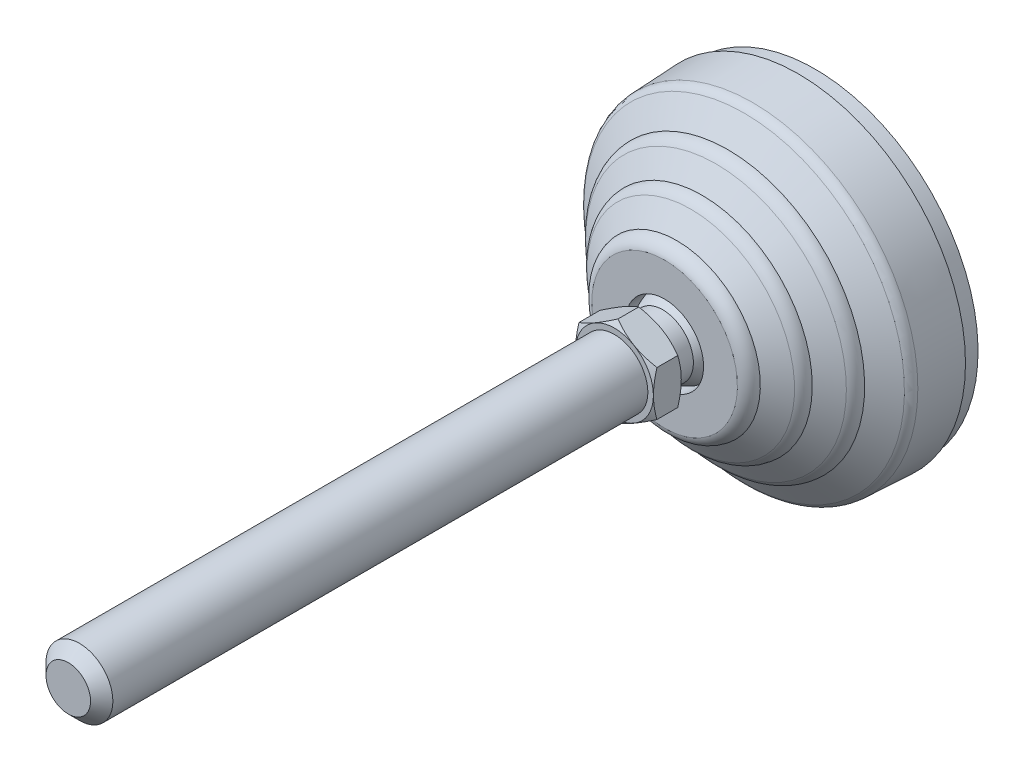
ISO-10303-21;
HEADER;
FILE_DESCRIPTION(('STEP AP214'),'2;1');
FILE_NAME('part.step','',(''),(''),'','','');
FILE_SCHEMA(('AUTOMOTIVE_DESIGN { 1 0 10303 214 1 1 1 1 }'));
ENDSEC;
DATA;
#1=APPLICATION_CONTEXT('core data for automotive mechanical design processes');
#2=APPLICATION_PROTOCOL_DEFINITION('international standard','automotive_design',2000,#1);
#3=PRODUCT_CONTEXT('',#1,'mechanical');
#4=PRODUCT('Part','Part','',(#3));
#5=PRODUCT_RELATED_PRODUCT_CATEGORY('part','',(#4));
#6=PRODUCT_DEFINITION_FORMATION('','',#4);
#7=PRODUCT_DEFINITION_CONTEXT('part definition',#1,'design');
#8=PRODUCT_DEFINITION('design','',#6,#7);
#9=PRODUCT_DEFINITION_SHAPE('','',#8);
#10=(LENGTH_UNIT() NAMED_UNIT(*) SI_UNIT(.MILLI.,.METRE.));
#11=(NAMED_UNIT(*) PLANE_ANGLE_UNIT() SI_UNIT($,.RADIAN.));
#12=(NAMED_UNIT(*) SI_UNIT($,.STERADIAN.) SOLID_ANGLE_UNIT());
#13=UNCERTAINTY_MEASURE_WITH_UNIT(LENGTH_MEASURE(1.E-05),#10,'distance_accuracy_value','');
#14=(GEOMETRIC_REPRESENTATION_CONTEXT(3) GLOBAL_UNCERTAINTY_ASSIGNED_CONTEXT((#13)) GLOBAL_UNIT_ASSIGNED_CONTEXT((#10,
#11,#12)) REPRESENTATION_CONTEXT('',''));
#15=CARTESIAN_POINT('',(0.,0.,0.));
#16=DIRECTION('',(0.,0.,1.));
#17=DIRECTION('',(1.,0.,0.));
#18=AXIS2_PLACEMENT_3D('',#15,#16,#17);
#19=CARTESIAN_POINT('',(0.,0.,35.));
#20=DIRECTION('',(0.,0.,-1.));
#21=DIRECTION('',(0.,1.,0.));
#22=AXIS2_PLACEMENT_3D('',#19,#20,#21);
#23=CYLINDRICAL_SURFACE('',#22,7.);
#24=CARTESIAN_POINT('',(-7.,0.,23.));
#25=CARTESIAN_POINT('',(-7.00000242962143,-0.114537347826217,23.));
#26=CARTESIAN_POINT('',(-6.99718891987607,-0.229074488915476,23.));
#27=CARTESIAN_POINT('',(-6.98594746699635,-0.45787295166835,23.));
#28=CARTESIAN_POINT('',(-6.97751952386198,-0.572134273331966,23.));
#29=CARTESIAN_POINT('',(-6.95506664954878,-0.800105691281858,23.));
#30=CARTESIAN_POINT('',(-6.94104171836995,-0.913815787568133,23.));
#31=CARTESIAN_POINT('',(-6.90742942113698,-1.14041085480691,23.));
#32=CARTESIAN_POINT('',(-6.88784205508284,-1.25329582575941,23.));
#33=CARTESIAN_POINT('',(-6.84315187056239,-1.47796868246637,23.));
#34=CARTESIAN_POINT('',(-6.81804905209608,-1.58975656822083,23.));
#35=CARTESIAN_POINT('',(-6.76238849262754,-1.81196595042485,23.));
#36=CARTESIAN_POINT('',(-6.73183075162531,-1.9223874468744,23.));
#37=CARTESIAN_POINT('',(-6.66533394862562,-2.14159803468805,23.));
#38=CARTESIAN_POINT('',(-6.62939488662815,-2.25038712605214,23.));
#39=CARTESIAN_POINT('',(-6.55222202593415,-2.46607082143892,23.));
#40=CARTESIAN_POINT('',(-6.51098822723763,-2.5729654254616,23.));
#41=CARTESIAN_POINT('',(-6.42332522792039,-2.78460262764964,23.));
#42=CARTESIAN_POINT('',(-6.37689602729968,-2.88934522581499,23.));
#43=CARTESIAN_POINT('',(-6.27895407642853,-3.09642608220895,23.));
#44=CARTESIAN_POINT('',(-6.22744132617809,-3.19876434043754,23.));
#45=CARTESIAN_POINT('',(-6.11945637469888,-3.40078997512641,23.));
#46=CARTESIAN_POINT('',(-6.06298417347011,-3.50047735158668,23.));
#47=CARTESIAN_POINT('',(-5.94521636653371,-3.69696106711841,23.));
#48=CARTESIAN_POINT('',(-5.88392076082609,-3.79375740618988,23.));
#49=CARTESIAN_POINT('',(-5.75665381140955,-3.98422585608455,23.));
#50=CARTESIAN_POINT('',(-5.69068246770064,-4.07789796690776,23.));
#51=CARTESIAN_POINT('',(-5.55422297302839,-4.26189229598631,23.));
#52=CARTESIAN_POINT('',(-5.48373482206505,-4.35221451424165,23.));
#53=CARTESIAN_POINT('',(-5.33841152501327,-4.52929146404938,23.));
#54=CARTESIAN_POINT('',(-5.26357637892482,-4.61604619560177,23.));
#55=CARTESIAN_POINT('',(-5.10973937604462,-4.78577917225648,23.));
#56=CARTESIAN_POINT('',(-5.03073751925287,-4.8687574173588,23.));
#57=CARTESIAN_POINT('',(-4.8687574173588,-5.03073751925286,23.));
#58=CARTESIAN_POINT('',(-4.78577917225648,-5.10973937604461,23.));
#59=CARTESIAN_POINT('',(-4.61604619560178,-5.26357637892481,23.));
#60=CARTESIAN_POINT('',(-4.52929146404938,-5.33841152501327,23.));
#61=CARTESIAN_POINT('',(-4.35221451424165,-5.48373482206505,23.));
#62=CARTESIAN_POINT('',(-4.26189229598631,-5.55422297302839,23.));
#63=CARTESIAN_POINT('',(-4.07789796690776,-5.69068246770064,23.));
#64=CARTESIAN_POINT('',(-3.98422585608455,-5.75665381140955,23.));
#65=CARTESIAN_POINT('',(-3.79375740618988,-5.88392076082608,23.));
#66=CARTESIAN_POINT('',(-3.69696106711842,-5.9452163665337,23.));
#67=CARTESIAN_POINT('',(-3.50047735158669,-6.0629841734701,23.));
#68=CARTESIAN_POINT('',(-3.40078997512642,-6.11945637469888,23.));
#69=CARTESIAN_POINT('',(-3.19876434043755,-6.22744132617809,23.));
#70=CARTESIAN_POINT('',(-3.09642608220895,-6.27895407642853,23.));
#71=CARTESIAN_POINT('',(-2.88934522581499,-6.37689602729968,23.));
#72=CARTESIAN_POINT('',(-2.78460262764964,-6.42332522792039,23.));
#73=CARTESIAN_POINT('',(-2.57296542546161,-6.51098822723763,23.));
#74=CARTESIAN_POINT('',(-2.46607082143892,-6.55222202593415,23.));
#75=CARTESIAN_POINT('',(-2.25038712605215,-6.62939488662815,23.));
#76=CARTESIAN_POINT('',(-2.14159803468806,-6.66533394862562,23.));
#77=CARTESIAN_POINT('',(-1.92238744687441,-6.73183075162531,23.));
#78=CARTESIAN_POINT('',(-1.81196595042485,-6.76238849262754,23.));
#79=CARTESIAN_POINT('',(-1.58975656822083,-6.81804905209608,23.));
#80=CARTESIAN_POINT('',(-1.47796868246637,-6.84315187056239,23.));
#81=CARTESIAN_POINT('',(-1.25329582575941,-6.88784205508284,23.));
#82=CARTESIAN_POINT('',(-1.14041085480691,-6.90742942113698,23.));
#83=CARTESIAN_POINT('',(-0.913815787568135,-6.94104171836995,23.));
#84=CARTESIAN_POINT('',(-0.80010569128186,-6.95506664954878,23.));
#85=CARTESIAN_POINT('',(-0.572134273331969,-6.97751952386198,23.));
#86=CARTESIAN_POINT('',(-0.457872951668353,-6.98594746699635,23.));
#87=CARTESIAN_POINT('',(-0.229074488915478,-6.99718891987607,23.));
#88=CARTESIAN_POINT('',(-0.11453734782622,-7.00000242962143,23.));
#89=CARTESIAN_POINT('',(0.,-7.,23.));
#90=B_SPLINE_CURVE_WITH_KNOTS('',3,(#24,#25,#26,#27,#28,#29,#30,#31,#32,#33,#34,#35,#36,#37,#38,
#39,#40,#41,#42,#43,#44,#45,#46,#47,#48,#49,#50,#51,#52,#53,#54,#55,#56,#57,#58,#59,#60,#61,#62,
#63,#64,#65,#66,#67,#68,#69,#70,#71,#72,#73,#74,#75,#76,#77,#78,#79,#80,#81,#82,#83,#84,#85,#86,
#87,#88,#89),.UNSPECIFIED.,.F.,.F.,(4,2,2,2,2,2,2,2,2,2,2,2,2,2,2,2,2,2,2,2,2,2,2,2,2,2,2,2,2,2,
2,2,4),(0.,0.343577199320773,0.687154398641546,1.03073159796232,1.37430879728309,
1.71788599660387,2.06146319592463,2.40504039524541,2.74861759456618,3.09219479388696,
3.43577199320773,3.7793491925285,4.12292639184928,4.46650359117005,4.81008079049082,
5.15365798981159,5.49723518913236,5.84081238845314,6.18438958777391,6.52796678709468,
6.87154398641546,7.21512118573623,7.558698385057,7.90227558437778,8.24585278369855,
8.58942998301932,8.93300718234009,9.27658438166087,9.62016158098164,9.96373878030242,
10.3073159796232,10.650893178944,10.9944703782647),.UNSPECIFIED.);
#91=CARTESIAN_POINT('',(-7.,0.,23.0001794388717));
#92=VERTEX_POINT('',#91);
#93=CARTESIAN_POINT('',(0.,-7.,23.));
#94=VERTEX_POINT('',#93);
#95=EDGE_CURVE('E138',#92,#94,#90,.T.);
#96=ORIENTED_EDGE('',*,*,#95,.F.);
#97=CARTESIAN_POINT('',(0.,0.,23.));
#98=DIRECTION('',(0.,0.,-1.));
#99=DIRECTION('',(0.,1.,0.));
#100=AXIS2_PLACEMENT_3D('',#97,#98,#99);
#101=CIRCLE('',#100,7.);
#102=CARTESIAN_POINT('',(0.,7.,23.));
#103=VERTEX_POINT('',#102);
#104=EDGE_CURVE('E134',#103,#92,#101,.F.);
#105=ORIENTED_EDGE('',*,*,#104,.F.);
#106=CARTESIAN_POINT('',(7.,0.,23.));
#107=CARTESIAN_POINT('',(7.00000242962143,0.114537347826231,22.9999999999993));
#108=CARTESIAN_POINT('',(6.99718891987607,0.22907448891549,22.9999999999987));
#109=CARTESIAN_POINT('',(6.98594746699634,0.457872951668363,22.9999999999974));
#110=CARTESIAN_POINT('',(6.97751952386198,0.572134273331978,22.9999999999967));
#111=CARTESIAN_POINT('',(6.95506664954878,0.800105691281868,22.9999999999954));
#112=CARTESIAN_POINT('',(6.94104171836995,0.913815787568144,22.9999999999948));
#113=CARTESIAN_POINT('',(6.90742942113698,1.14041085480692,22.9999999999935));
#114=CARTESIAN_POINT('',(6.88784205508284,1.25329582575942,22.9999999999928));
#115=CARTESIAN_POINT('',(6.84315187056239,1.47796868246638,22.9999999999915));
#116=CARTESIAN_POINT('',(6.81804905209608,1.58975656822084,22.9999999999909));
#117=CARTESIAN_POINT('',(6.76238849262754,1.81196595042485,22.9999999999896));
#118=CARTESIAN_POINT('',(6.73183075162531,1.92238744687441,22.999999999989));
#119=CARTESIAN_POINT('',(6.66533394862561,2.14159803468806,22.9999999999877));
#120=CARTESIAN_POINT('',(6.62939488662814,2.25038712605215,22.9999999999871));
#121=CARTESIAN_POINT('',(6.55222202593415,2.46607082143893,22.9999999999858));
#122=CARTESIAN_POINT('',(6.51098822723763,2.57296542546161,22.9999999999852));
#123=CARTESIAN_POINT('',(6.42332522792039,2.78460262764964,22.999999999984));
#124=CARTESIAN_POINT('',(6.37689602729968,2.88934522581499,22.9999999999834));
#125=CARTESIAN_POINT('',(6.27895407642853,3.09642608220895,22.9999999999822));
#126=CARTESIAN_POINT('',(6.22744132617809,3.19876434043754,22.9999999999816));
#127=CARTESIAN_POINT('',(6.11945637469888,3.40078997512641,22.9999999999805));
#128=CARTESIAN_POINT('',(6.06298417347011,3.50047735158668,22.9999999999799));
#129=CARTESIAN_POINT('',(5.94521636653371,3.69696106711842,22.9999999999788));
#130=CARTESIAN_POINT('',(5.88392076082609,3.79375740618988,22.9999999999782));
#131=CARTESIAN_POINT('',(5.75665381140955,3.98422585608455,22.9999999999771));
#132=CARTESIAN_POINT('',(5.69068246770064,4.07789796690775,22.9999999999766));
#133=CARTESIAN_POINT('',(5.55422297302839,4.26189229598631,22.9999999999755));
#134=CARTESIAN_POINT('',(5.48373482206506,4.35221451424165,22.999999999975));
#135=CARTESIAN_POINT('',(5.33841152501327,4.52929146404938,22.999999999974));
#136=CARTESIAN_POINT('',(5.26357637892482,4.61604619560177,22.9999999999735));
#137=CARTESIAN_POINT('',(5.10973937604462,4.78577917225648,22.9999999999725));
#138=CARTESIAN_POINT('',(5.03073751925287,4.8687574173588,22.9999999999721));
#139=CARTESIAN_POINT('',(4.8687574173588,5.03073751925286,22.9999999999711));
#140=CARTESIAN_POINT('',(4.78577917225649,5.10973937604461,22.9999999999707));
#141=CARTESIAN_POINT('',(4.61604619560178,5.26357637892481,22.9999999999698));
#142=CARTESIAN_POINT('',(4.52929146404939,5.33841152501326,22.9999999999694));
#143=CARTESIAN_POINT('',(4.35221451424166,5.48373482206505,22.9999999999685));
#144=CARTESIAN_POINT('',(4.26189229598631,5.55422297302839,22.9999999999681));
#145=CARTESIAN_POINT('',(4.07789796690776,5.69068246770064,22.9999999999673));
#146=CARTESIAN_POINT('',(3.98422585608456,5.75665381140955,22.999999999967));
#147=CARTESIAN_POINT('',(3.79375740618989,5.88392076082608,22.9999999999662));
#148=CARTESIAN_POINT('',(3.69696106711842,5.9452163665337,22.9999999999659));
#149=CARTESIAN_POINT('',(3.50047735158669,6.0629841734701,22.9999999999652));
#150=CARTESIAN_POINT('',(3.40078997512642,6.11945637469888,22.9999999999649));
#151=CARTESIAN_POINT('',(3.19876434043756,6.22744132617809,22.9999999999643));
#152=CARTESIAN_POINT('',(3.09642608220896,6.27895407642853,22.999999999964));
#153=CARTESIAN_POINT('',(2.88934522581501,6.37689602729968,22.9999999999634));
#154=CARTESIAN_POINT('',(2.78460262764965,6.42332522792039,22.9999999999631));
#155=CARTESIAN_POINT('',(2.57296542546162,6.51098822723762,22.9999999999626));
#156=CARTESIAN_POINT('',(2.46607082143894,6.55222202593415,22.9999999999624));
#157=CARTESIAN_POINT('',(2.25038712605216,6.62939488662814,22.999999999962));
#158=CARTESIAN_POINT('',(2.14159803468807,6.66533394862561,22.9999999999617));
#159=CARTESIAN_POINT('',(1.92238744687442,6.73183075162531,22.9999999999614));
#160=CARTESIAN_POINT('',(1.81196595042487,6.76238849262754,22.9999999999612));
#161=CARTESIAN_POINT('',(1.58975656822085,6.81804905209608,22.9999999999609));
#162=CARTESIAN_POINT('',(1.47796868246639,6.84315187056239,22.9999999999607));
#163=CARTESIAN_POINT('',(1.25329582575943,6.88784205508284,22.9999999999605));
#164=CARTESIAN_POINT('',(1.14041085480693,6.90742942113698,22.9999999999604));
#165=CARTESIAN_POINT('',(0.913815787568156,6.94104171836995,22.9999999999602));
#166=CARTESIAN_POINT('',(0.80010569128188,6.95506664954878,22.9999999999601));
#167=CARTESIAN_POINT('',(0.572134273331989,6.97751952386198,22.9999999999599));
#168=CARTESIAN_POINT('',(0.457872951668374,6.98594746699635,22.9999999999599));
#169=CARTESIAN_POINT('',(0.229074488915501,6.99718891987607,22.9999999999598));
#170=CARTESIAN_POINT('',(0.114537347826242,7.00000242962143,22.9999999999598));
#171=CARTESIAN_POINT('',(0.,7.,22.9999999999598));
#172=B_SPLINE_CURVE_WITH_KNOTS('',3,(#106,#107,#108,#109,#110,#111,#112,#113,#114,#115,#116,
#117,#118,#119,#120,#121,#122,#123,#124,#125,#126,#127,#128,#129,#130,#131,#132,#133,#134,#135,
#136,#137,#138,#139,#140,#141,#142,#143,#144,#145,#146,#147,#148,#149,#150,#151,#152,#153,#154,
#155,#156,#157,#158,#159,#160,#161,#162,#163,#164,#165,#166,#167,#168,#169,#170,#171),
.UNSPECIFIED.,.F.,.F.,(4,2,2,2,2,2,2,2,2,2,2,2,2,2,2,2,2,2,2,2,2,2,2,2,2,2,2,2,2,2,2,2,4),(0.,
0.343577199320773,0.687154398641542,1.03073159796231,1.37430879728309,1.71788599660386,
2.06146319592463,2.4050403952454,2.74861759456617,3.09219479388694,3.43577199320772,
3.77934919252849,4.12292639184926,4.46650359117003,4.8100807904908,5.15365798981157,
5.49723518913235,5.84081238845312,6.18438958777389,6.52796678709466,6.87154398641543,
7.21512118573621,7.55869838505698,7.90227558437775,8.24585278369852,8.58942998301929,
8.93300718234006,9.27658438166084,9.62016158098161,9.96373878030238,10.3073159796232,
10.6508931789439,10.9944703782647),.UNSPECIFIED.);
#173=CARTESIAN_POINT('',(7.,0.,23.));
#174=VERTEX_POINT('',#173);
#175=EDGE_CURVE('E31',#174,#103,#172,.T.);
#176=ORIENTED_EDGE('',*,*,#175,.F.);
#177=CARTESIAN_POINT('',(0.,0.,23.));
#178=DIRECTION('',(0.,0.,-1.));
#179=DIRECTION('',(0.,1.,0.));
#180=AXIS2_PLACEMENT_3D('',#177,#178,#179);
#181=CIRCLE('',#180,7.);
#182=EDGE_CURVE('E135',#94,#174,#181,.F.);
#183=ORIENTED_EDGE('',*,*,#182,.F.);
#184=EDGE_LOOP('',(#96,#105,#176,#183));
#185=FACE_BOUND('',#184,.T.);
#186=CARTESIAN_POINT('',(0.,0.,27.));
#187=DIRECTION('',(0.,0.,-1.));
#188=DIRECTION('',(0.,1.,0.));
#189=AXIS2_PLACEMENT_3D('',#186,#187,#188);
#190=CIRCLE('',#189,7.);
#191=CARTESIAN_POINT('',(0.,7.,27.));
#192=VERTEX_POINT('',#191);
#193=EDGE_CURVE('E161',#192,#192,#190,.T.);
#194=ORIENTED_EDGE('',*,*,#193,.F.);
#195=EDGE_LOOP('',(#194));
#196=FACE_BOUND('',#195,.T.);
#197=ADVANCED_FACE('F14',(#185,#196),#23,.F.);
#198=CARTESIAN_POINT('',(-6.53226682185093,0.,27.));
#199=DIRECTION('',(0.,0.,1.));
#200=DIRECTION('',(-1.,0.,0.));
#201=AXIS2_PLACEMENT_3D('',#198,#199,#200);
#202=PLANE('',#201);
#203=CARTESIAN_POINT('',(0.,0.,27.));
#204=DIRECTION('',(0.,0.,-1.));
#205=DIRECTION('',(0.,1.,0.));
#206=AXIS2_PLACEMENT_3D('',#203,#204,#205);
#207=CIRCLE('',#206,13.0645336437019);
#208=CARTESIAN_POINT('',(0.,13.0645336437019,27.));
#209=VERTEX_POINT('',#208);
#210=EDGE_CURVE('E157',#209,#209,#207,.T.);
#211=ORIENTED_EDGE('',*,*,#210,.F.);
#212=EDGE_LOOP('',(#211));
#213=FACE_BOUND('',#212,.T.);
#214=ORIENTED_EDGE('',*,*,#193,.T.);
#215=EDGE_LOOP('',(#214));
#216=FACE_BOUND('',#215,.T.);
#217=ADVANCED_FACE('F310',(#213,#216),#202,.T.);
#218=CARTESIAN_POINT('',(0.,0.,24.5842));
#219=DIRECTION('',(0.,0.,-1.));
#220=DIRECTION('',(0.,1.,0.));
#221=AXIS2_PLACEMENT_3D('',#218,#219,#220);
#222=TOROIDAL_SURFACE('',#221,12.5253,2.47525);
#223=ORIENTED_EDGE('',*,*,#210,.T.);
#224=EDGE_LOOP('',(#223));
#225=FACE_BOUND('',#224,.T.);
#226=CARTESIAN_POINT('',(0.,0.,24.8062186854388));
#227=DIRECTION('',(0.,0.,-1.));
#228=DIRECTION('',(-1.,0.,0.));
#229=AXIS2_PLACEMENT_3D('',#226,#227,#228);
#230=CIRCLE('',#229,14.9905728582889);
#231=CARTESIAN_POINT('',(-14.9905728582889,0.,24.8062186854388));
#232=VERTEX_POINT('',#231);
#233=EDGE_CURVE('E160',#232,#232,#230,.T.);
#234=ORIENTED_EDGE('',*,*,#233,.F.);
#235=EDGE_LOOP('',(#234));
#236=FACE_BOUND('',#235,.T.);
#237=ADVANCED_FACE('F396',(#225,#236),#222,.T.);
#238=CARTESIAN_POINT('',(0.,0.,22.3004110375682));
#239=DIRECTION('',(0.,0.,-1.));
#240=DIRECTION('',(0.,1.,0.));
#241=AXIS2_PLACEMENT_3D('',#238,#239,#240);
#242=CONICAL_SURFACE('',#241,18.63040749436,0.967870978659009);
#243=ORIENTED_EDGE('',*,*,#233,.T.);
#244=EDGE_LOOP('',(#243));
#245=FACE_BOUND('',#244,.T.);
#246=CARTESIAN_POINT('',(0.,0.,22.3004110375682));
#247=DIRECTION('',(0.,0.,-1.));
#248=DIRECTION('',(0.,1.,0.));
#249=AXIS2_PLACEMENT_3D('',#246,#247,#248);
#250=CIRCLE('',#249,18.63040749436);
#251=CARTESIAN_POINT('',(0.,18.63040749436,22.3004110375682));
#252=VERTEX_POINT('',#251);
#253=EDGE_CURVE('E390',#252,#252,#250,.T.);
#254=ORIENTED_EDGE('',*,*,#253,.F.);
#255=EDGE_LOOP('',(#254));
#256=FACE_BOUND('',#255,.T.);
#257=ADVANCED_FACE('F383',(#245,#256),#242,.T.);
#258=CARTESIAN_POINT('',(0.,0.,20.149417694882));
#259=DIRECTION('',(0.,0.,-1.));
#260=DIRECTION('',(0.,1.,0.));
#261=AXIS2_PLACEMENT_3D('',#258,#259,#260);
#262=TOROIDAL_SURFACE('',#261,17.1699621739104,2.59993709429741);
#263=CARTESIAN_POINT('',(0.,0.,20.266146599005));
#264=DIRECTION('',(0.,0.,-1.));
#265=DIRECTION('',(-1.,0.,0.));
#266=AXIS2_PLACEMENT_3D('',#263,#264,#265);
#267=CIRCLE('',#266,19.7672775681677);
#268=CARTESIAN_POINT('',(-19.7672775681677,0.,20.266146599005));
#269=VERTEX_POINT('',#268);
#270=EDGE_CURVE('E387',#269,#269,#267,.T.);
#271=ORIENTED_EDGE('',*,*,#270,.F.);
#272=EDGE_LOOP('',(#271));
#273=FACE_BOUND('',#272,.T.);
#274=ORIENTED_EDGE('',*,*,#253,.T.);
#275=EDGE_LOOP('',(#274));
#276=FACE_BOUND('',#275,.T.);
#277=ADVANCED_FACE('F379',(#273,#276),#262,.T.);
#278=CARTESIAN_POINT('',(0.,0.,17.7704000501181));
#279=DIRECTION('',(0.,0.,-1.));
#280=DIRECTION('',(0.,1.,0.));
#281=AXIS2_PLACEMENT_3D('',#278,#279,#280);
#282=CONICAL_SURFACE('',#281,23.3925000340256,0.967871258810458);
#283=CARTESIAN_POINT('',(0.,0.,17.7704000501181));
#284=DIRECTION('',(0.,0.,-1.));
#285=DIRECTION('',(0.,1.,0.));
#286=AXIS2_PLACEMENT_3D('',#283,#284,#285);
#287=CIRCLE('',#286,23.3925000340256);
#288=CARTESIAN_POINT('',(0.,23.3925000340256,17.7704000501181));
#289=VERTEX_POINT('',#288);
#290=EDGE_CURVE('E368',#289,#289,#287,.T.);
#291=ORIENTED_EDGE('',*,*,#290,.F.);
#292=EDGE_LOOP('',(#291));
#293=FACE_BOUND('',#292,.T.);
#294=ORIENTED_EDGE('',*,*,#270,.T.);
#295=EDGE_LOOP('',(#294));
#296=FACE_BOUND('',#295,.T.);
#297=ADVANCED_FACE('F375',(#293,#296),#282,.T.);
#298=CARTESIAN_POINT('',(0.,0.,15.6193000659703));
#299=DIRECTION('',(0.,0.,-1.));
#300=DIRECTION('',(0.,1.,0.));
#301=AXIS2_PLACEMENT_3D('',#298,#299,#300);
#302=TOROIDAL_SURFACE('',#301,21.9321002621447,2.59999973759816);
#303=ORIENTED_EDGE('',*,*,#290,.T.);
#304=EDGE_LOOP('',(#303));
#305=FACE_BOUND('',#304,.T.);
#306=CARTESIAN_POINT('',(0.,0.,15.6295138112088));
#307=DIRECTION('',(0.,0.,-1.));
#308=DIRECTION('',(-1.,0.,0.));
#309=AXIS2_PLACEMENT_3D('',#306,#307,#308);
#310=CIRCLE('',#309,24.5320799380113);
#311=CARTESIAN_POINT('',(-24.5320799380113,0.,15.6295138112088));
#312=VERTEX_POINT('',#311);
#313=EDGE_CURVE('E365',#312,#312,#310,.T.);
#314=ORIENTED_EDGE('',*,*,#313,.F.);
#315=EDGE_LOOP('',(#314));
#316=FACE_BOUND('',#315,.T.);
#317=ADVANCED_FACE('F372',(#305,#316),#302,.T.);
#318=CARTESIAN_POINT('',(0.,0.,12.7183562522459));
#319=DIRECTION('',(0.,0.,-1.));
#320=DIRECTION('',(0.,1.,0.));
#321=AXIS2_PLACEMENT_3D('',#318,#319,#320);
#322=CONICAL_SURFACE('',#321,28.760790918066,0.967879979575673);
#323=ORIENTED_EDGE('',*,*,#313,.T.);
#324=EDGE_LOOP('',(#323));
#325=FACE_BOUND('',#324,.T.);
#326=CARTESIAN_POINT('',(0.,0.,12.7183562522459));
#327=DIRECTION('',(0.,0.,-1.));
#328=DIRECTION('',(0.,1.,0.));
#329=AXIS2_PLACEMENT_3D('',#326,#327,#328);
#330=CIRCLE('',#329,28.760790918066);
#331=CARTESIAN_POINT('',(0.,28.760790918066,12.7183562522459));
#332=VERTEX_POINT('',#331);
#333=EDGE_CURVE('E362',#332,#332,#330,.T.);
#334=ORIENTED_EDGE('',*,*,#333,.F.);
#335=EDGE_LOOP('',(#334));
#336=FACE_BOUND('',#335,.T.);
#337=ADVANCED_FACE('F355',(#325,#336),#322,.T.);
#338=CARTESIAN_POINT('',(0.,0.,11.0710969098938));
#339=DIRECTION('',(0.,0.,-1.));
#340=DIRECTION('',(0.,1.,0.));
#341=AXIS2_PLACEMENT_3D('',#338,#339,#340);
#342=TOROIDAL_SURFACE('',#341,27.6268354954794,1.9998295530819);
#343=CARTESIAN_POINT('',(0.,0.,11.1756615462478));
#344=DIRECTION('',(0.,0.,-1.));
#345=DIRECTION('',(-1.,0.,0.));
#346=AXIS2_PLACEMENT_3D('',#343,#344,#345);
#347=CIRCLE('',#346,29.6239295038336);
#348=CARTESIAN_POINT('',(-29.6239295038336,0.,11.1756615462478));
#349=VERTEX_POINT('',#348);
#350=EDGE_CURVE('E156',#349,#349,#347,.T.);
#351=ORIENTED_EDGE('',*,*,#350,.F.);
#352=EDGE_LOOP('',(#351));
#353=FACE_BOUND('',#352,.T.);
#354=ORIENTED_EDGE('',*,*,#333,.T.);
#355=EDGE_LOOP('',(#354));
#356=FACE_BOUND('',#355,.T.);
#357=ADVANCED_FACE('F350',(#353,#356),#342,.T.);
#358=CARTESIAN_POINT('',(0.,0.,3.00000000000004));
#359=DIRECTION('',(0.,0.,-1.));
#360=DIRECTION('',(0.,1.,0.));
#361=AXIS2_PLACEMENT_3D('',#358,#359,#360);
#362=CONICAL_SURFACE('',#361,30.,0.0459663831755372);
#363=CARTESIAN_POINT('',(0.,0.,3.));
#364=DIRECTION('',(0.,0.,-1.));
#365=DIRECTION('',(0.,1.,0.));
#366=AXIS2_PLACEMENT_3D('',#363,#364,#365);
#367=CIRCLE('',#366,30.);
#368=CARTESIAN_POINT('',(0.,30.,3.));
#369=VERTEX_POINT('',#368);
#370=EDGE_CURVE('E153',#369,#369,#367,.T.);
#371=ORIENTED_EDGE('',*,*,#370,.F.);
#372=EDGE_LOOP('',(#371));
#373=FACE_BOUND('',#372,.T.);
#374=ORIENTED_EDGE('',*,*,#350,.T.);
#375=EDGE_LOOP('',(#374));
#376=FACE_BOUND('',#375,.T.);
#377=ADVANCED_FACE('F346',(#373,#376),#362,.T.);
#378=CARTESIAN_POINT('',(-29.625,0.,3.));
#379=DIRECTION('',(0.,0.,-1.));
#380=DIRECTION('',(0.,1.,0.));
#381=AXIS2_PLACEMENT_3D('',#378,#379,#380);
#382=PLANE('',#381);
#383=ORIENTED_EDGE('',*,*,#370,.T.);
#384=EDGE_LOOP('',(#383));
#385=FACE_BOUND('',#384,.T.);
#386=CARTESIAN_POINT('',(0.,0.,3.));
#387=DIRECTION('',(0.,0.,1.));
#388=DIRECTION('',(0.,-1.,0.));
#389=AXIS2_PLACEMENT_3D('',#386,#387,#388);
#390=CIRCLE('',#389,29.25);
#391=CARTESIAN_POINT('',(0.,-29.25,3.));
#392=VERTEX_POINT('',#391);
#393=EDGE_CURVE('E150',#392,#392,#390,.F.);
#394=ORIENTED_EDGE('',*,*,#393,.F.);
#395=EDGE_LOOP('',(#394));
#396=FACE_BOUND('',#395,.T.);
#397=ADVANCED_FACE('F342',(#385,#396),#382,.T.);
#398=CARTESIAN_POINT('',(0.,0.,1.5));
#399=DIRECTION('',(0.,0.,1.));
#400=DIRECTION('',(0.,-1.,0.));
#401=AXIS2_PLACEMENT_3D('',#398,#399,#400);
#402=CYLINDRICAL_SURFACE('',#401,29.25);
#403=CARTESIAN_POINT('',(0.,0.,0.));
#404=DIRECTION('',(0.,0.,1.));
#405=DIRECTION('',(0.,-1.,0.));
#406=AXIS2_PLACEMENT_3D('',#403,#404,#405);
#407=CIRCLE('',#406,29.25);
#408=CARTESIAN_POINT('',(0.,-29.25,0.));
#409=VERTEX_POINT('',#408);
#410=EDGE_CURVE('E147',#409,#409,#407,.F.);
#411=ORIENTED_EDGE('',*,*,#410,.F.);
#412=EDGE_LOOP('',(#411));
#413=FACE_BOUND('',#412,.T.);
#414=ORIENTED_EDGE('',*,*,#393,.T.);
#415=EDGE_LOOP('',(#414));
#416=FACE_BOUND('',#415,.T.);
#417=ADVANCED_FACE('F302',(#413,#416),#402,.T.);
#418=CARTESIAN_POINT('',(-14.625,0.,0.));
#419=DIRECTION('',(0.,0.,-1.));
#420=DIRECTION('',(0.,1.,0.));
#421=AXIS2_PLACEMENT_3D('',#418,#419,#420);
#422=PLANE('',#421);
#423=ORIENTED_EDGE('',*,*,#410,.T.);
#424=EDGE_LOOP('',(#423));
#425=FACE_BOUND('',#424,.T.);
#426=ADVANCED_FACE('F117',(#425),#422,.T.);
#427=CARTESIAN_POINT('',(0.,0.,56.4265));
#428=DIRECTION('',(0.,0.,-1.));
#429=DIRECTION('',(0.,1.,0.));
#430=AXIS2_PLACEMENT_3D('',#427,#428,#429);
#431=CYLINDRICAL_SURFACE('',#430,6.);
#432=CARTESIAN_POINT('',(0.,0.,132.));
#433=DIRECTION('',(0.,0.,1.));
#434=DIRECTION('',(0.,-1.,0.));
#435=AXIS2_PLACEMENT_3D('',#432,#433,#434);
#436=CIRCLE('',#435,6.);
#437=CARTESIAN_POINT('',(0.,-6.,132.));
#438=VERTEX_POINT('',#437);
#439=EDGE_CURVE('E9',#438,#438,#436,.F.);
#440=ORIENTED_EDGE('',*,*,#439,.T.);
#441=EDGE_LOOP('',(#440));
#442=FACE_BOUND('',#441,.T.);
#443=CARTESIAN_POINT('',(0.,0.,36.));
#444=DIRECTION('',(0.,0.,-1.));
#445=DIRECTION('',(0.,1.,0.));
#446=AXIS2_PLACEMENT_3D('',#443,#444,#445);
#447=CIRCLE('',#446,6.);
#448=CARTESIAN_POINT('',(0.,6.,36.));
#449=VERTEX_POINT('',#448);
#450=EDGE_CURVE('E136',#449,#449,#447,.F.);
#451=ORIENTED_EDGE('',*,*,#450,.T.);
#452=EDGE_LOOP('',(#451));
#453=FACE_BOUND('',#452,.T.);
#454=ADVANCED_FACE('F293',(#442,#453),#431,.T.);
#455=CARTESIAN_POINT('',(6.495,0.,36.));
#456=DIRECTION('',(0.,0.,1.));
#457=DIRECTION('',(0.,-1.,0.));
#458=AXIS2_PLACEMENT_3D('',#455,#456,#457);
#459=PLANE('',#458);
#460=CARTESIAN_POINT('',(0.,0.,36.));
#461=DIRECTION('',(0.,0.,-1.));
#462=DIRECTION('',(0.,1.,0.));
#463=AXIS2_PLACEMENT_3D('',#460,#461,#462);
#464=CIRCLE('',#463,6.99);
#465=CARTESIAN_POINT('',(0.,6.99,36.));
#466=VERTEX_POINT('',#465);
#467=EDGE_CURVE('E601',#466,#466,#464,.F.);
#468=ORIENTED_EDGE('',*,*,#467,.T.);
#469=EDGE_LOOP('',(#468));
#470=FACE_BOUND('',#469,.T.);
#471=ORIENTED_EDGE('',*,*,#450,.F.);
#472=EDGE_LOOP('',(#471));
#473=FACE_BOUND('',#472,.T.);
#474=ADVANCED_FACE('F260',(#470,#473),#459,.T.);
#475=CARTESIAN_POINT('',(0.,0.,35.3652257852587));
#476=DIRECTION('',(0.,0.,-1.));
#477=DIRECTION('',(0.,1.,0.));
#478=AXIS2_PLACEMENT_3D('',#475,#476,#477);
#479=CONICAL_SURFACE('',#478,8.08946119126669,1.0471975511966);
#480=ORIENTED_EDGE('',*,*,#467,.F.);
#481=EDGE_LOOP('',(#480));
#482=FACE_BOUND('',#481,.T.);
#483=CARTESIAN_POINT('',(-2.30772558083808E-08,8.0829037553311,35.3690117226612));
#484=CARTESIAN_POINT('',(-0.153866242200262,7.99406905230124,35.4202905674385));
#485=CARTESIAN_POINT('',(-0.30830614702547,7.90490313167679,35.4692419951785));
#486=CARTESIAN_POINT('',(-0.618440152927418,7.72584717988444,35.5618490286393));
#487=CARTESIAN_POINT('',(-0.774134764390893,7.63595685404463,35.6055023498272));
#488=CARTESIAN_POINT('',(-1.24371128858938,7.3648467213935,35.7276582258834));
#489=CARTESIAN_POINT('',(-1.55944671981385,7.18255678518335,35.7971380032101));
#490=CARTESIAN_POINT('',(-2.03193900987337,6.90976323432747,35.878609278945));
#491=CARTESIAN_POINT('',(-2.18728424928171,6.82007461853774,35.9018177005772));
#492=CARTESIAN_POINT('',(-2.49867655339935,6.64029218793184,35.9407339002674));
#493=CARTESIAN_POINT('',(-2.65472355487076,6.55019840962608,35.9564423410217));
#494=CARTESIAN_POINT('',(-2.96708848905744,6.369854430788,35.9799582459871));
#495=CARTESIAN_POINT('',(-3.1234059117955,6.27960452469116,35.98777467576));
#496=CARTESIAN_POINT('',(-3.43617641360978,6.09902639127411,35.9953473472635));
#497=CARTESIAN_POINT('',(-3.59262948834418,6.00869816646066,35.9951038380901));
#498=CARTESIAN_POINT('',(-4.02123302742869,5.76124379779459,35.9833586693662));
#499=CARTESIAN_POINT('',(-4.29324310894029,5.60419870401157,35.9636515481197));
#500=CARTESIAN_POINT('',(-4.83545665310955,5.2911515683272,35.9011668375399));
#501=CARTESIAN_POINT('',(-5.10565820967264,5.13515062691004,35.8583679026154));
#502=CARTESIAN_POINT('',(-5.64896246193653,4.82147377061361,35.7513856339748));
#503=CARTESIAN_POINT('',(-5.92199662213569,4.66383742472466,35.6867491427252));
#504=CARTESIAN_POINT('',(-6.46399382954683,4.35091519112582,35.5400514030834));
#505=CARTESIAN_POINT('',(-6.73296381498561,4.19562529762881,35.4580246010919));
#506=CARTESIAN_POINT('',(-6.99999992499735,4.04145192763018,35.3690117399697));
#507=B_SPLINE_CURVE_WITH_KNOTS('',3,(#483,#484,#485,#486,#487,#488,#489,#490,#491,#492,#493,
#494,#495,#496,#497,#498,#499,#500,#501,#502,#503,#504,#505,#506),.UNSPECIFIED.,.F.,.F.,(4,2,2,
2,2,2,2,2,2,2,2,4),(0.,0.554720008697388,1.10967836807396,2.22190068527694,2.76439120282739,
3.30683377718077,3.8486594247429,4.39046832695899,5.33360242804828,6.27760984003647,
7.24255081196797,8.20559801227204),.UNSPECIFIED.);
#508=CARTESIAN_POINT('',(-1.15386261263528E-08,8.08290376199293,35.369011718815));
#509=VERTEX_POINT('',#508);
#510=CARTESIAN_POINT('',(-7.,4.04145190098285,35.3690117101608));
#511=VERTEX_POINT('',#510);
#512=EDGE_CURVE('E100',#509,#511,#507,.T.);
#513=ORIENTED_EDGE('',*,*,#512,.T.);
#514=CARTESIAN_POINT('',(-7.,4.04145191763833,35.3690117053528));
#515=CARTESIAN_POINT('',(-7.,3.70968878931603,35.4647934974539));
#516=CARTESIAN_POINT('',(-7.,3.37530112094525,35.5524844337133));
#517=CARTESIAN_POINT('',(-7.,2.70109388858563,35.7074672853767));
#518=CARTESIAN_POINT('',(-7.,2.36126392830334,35.7747135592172));
#519=CARTESIAN_POINT('',(-7.,1.68541720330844,35.882853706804));
#520=CARTESIAN_POINT('',(-7.,1.34949559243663,35.9243241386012));
#521=CARTESIAN_POINT('',(-7.,0.675714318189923,35.9799957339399));
#522=CARTESIAN_POINT('',(-7.,0.337857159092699,35.9942264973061));
#523=CARTESIAN_POINT('',(-7.,-0.337857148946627,35.9942264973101));
#524=CARTESIAN_POINT('',(-7.,-0.67571429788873,35.9799957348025));
#525=CARTESIAN_POINT('',(-7.,-1.34949555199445,35.9243241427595));
#526=CARTESIAN_POINT('',(-7.,-1.68541715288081,35.8828537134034));
#527=CARTESIAN_POINT('',(-7.,-2.3612638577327,35.7747135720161));
#528=CARTESIAN_POINT('',(-7.,-2.70109380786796,35.7074673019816));
#529=CARTESIAN_POINT('',(-7.,-3.37530102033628,35.5524844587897));
#530=CARTESIAN_POINT('',(-7.,-3.70968867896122,35.4647935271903));
#531=CARTESIAN_POINT('',(-7.,-4.04145179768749,35.3690117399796));
#532=B_SPLINE_CURVE_WITH_KNOTS('',3,(#514,#515,#516,#517,#518,#519,#520,#521,#522,#523,#524,
#525,#526,#527,#528,#529,#530,#531),.UNSPECIFIED.,.F.,.F.,(4,2,2,2,2,2,2,2,4),(0.,
1.03625689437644,2.07481046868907,3.08920803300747,4.10250268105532,5.11579729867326,
6.1301948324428,7.16874837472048,8.2050052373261),.UNSPECIFIED.);
#533=CARTESIAN_POINT('',(-7.00000001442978,-4.04145187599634,35.3690117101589));
#534=VERTEX_POINT('',#533);
#535=EDGE_CURVE('E274',#511,#534,#532,.T.);
#536=ORIENTED_EDGE('',*,*,#535,.T.);
#537=CARTESIAN_POINT('',(-7.00000002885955,-4.04145186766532,35.369011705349));
#538=CARTESIAN_POINT('',(-6.84613380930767,-4.13028657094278,35.4202905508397));
#539=CARTESIAN_POINT('',(-6.6916939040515,-4.21945249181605,35.4692419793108));
#540=CARTESIAN_POINT('',(-6.38155989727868,-4.39850844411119,35.5618490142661));
#541=CARTESIAN_POINT('',(-6.22586528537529,-4.48839877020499,35.6055023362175));
#542=CARTESIAN_POINT('',(-5.7562887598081,-4.75950890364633,35.7276582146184));
#543=CARTESIAN_POINT('',(-5.4405533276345,-4.94179884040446,35.7971379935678));
#544=CARTESIAN_POINT('',(-4.96806103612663,-5.21459239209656,35.8786092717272));
#545=CARTESIAN_POINT('',(-4.8127157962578,-5.30428100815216,35.9018176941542));
#546=CARTESIAN_POINT('',(-4.50132349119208,-5.48406343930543,35.9407338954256));
#547=CARTESIAN_POINT('',(-4.34527648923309,-5.57415721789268,35.9564423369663));
#548=CARTESIAN_POINT('',(-4.03291155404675,-5.75450119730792,35.9799582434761));
#549=CARTESIAN_POINT('',(-3.87659413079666,-5.84475110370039,35.9877746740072));
#550=CARTESIAN_POINT('',(-3.56382362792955,-6.02532923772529,35.9953473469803));
#551=CARTESIAN_POINT('',(-3.40737055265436,-6.11565746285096,35.9951038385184));
#552=CARTESIAN_POINT('',(-2.97876700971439,-6.36311183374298,35.9833586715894));
#553=CARTESIAN_POINT('',(-2.70675692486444,-6.52015692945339,35.9636515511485));
#554=CARTESIAN_POINT('',(-2.16454337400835,-6.83320406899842,35.9011668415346));
#555=CARTESIAN_POINT('',(-1.89434181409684,-6.98920501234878,35.8583679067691));
#556=CARTESIAN_POINT('',(-1.35103755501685,-7.30288187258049,35.7513856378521));
#557=CARTESIAN_POINT('',(-1.0780033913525,-7.46051822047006,35.6867491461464));
#558=CARTESIAN_POINT('',(-0.536006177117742,-7.77344045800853,35.5400514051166));
#559=CARTESIAN_POINT('',(-0.267036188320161,-7.92873035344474,35.4580246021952));
#560=CARTESIAN_POINT('',(-7.50026377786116E-08,-8.08290372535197,35.3690117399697));
#561=B_SPLINE_CURVE_WITH_KNOTS('',3,(#537,#538,#539,#540,#541,#542,#543,#544,#545,#546,#547,
#548,#549,#550,#551,#552,#553,#554,#555,#556,#557,#558,#559,#560),.UNSPECIFIED.,.F.,.F.,(4,2,2,
2,2,2,2,2,2,2,2,4),(0.,0.55472001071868,1.10967837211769,2.22190069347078,2.76439121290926,
3.30683378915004,3.84865943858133,4.39046834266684,5.33360245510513,6.27760987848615,
7.24255086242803,8.20559807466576),.UNSPECIFIED.);
#562=CARTESIAN_POINT('',(-1.44240629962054E-08,-8.0829037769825,35.3690117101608));
#563=VERTEX_POINT('',#562);
#564=EDGE_CURVE('E245',#534,#563,#561,.T.);
#565=ORIENTED_EDGE('',*,*,#564,.T.);
#566=CARTESIAN_POINT('',(-2.884812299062E-08,-8.08290378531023,35.3690117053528));
#567=CARTESIAN_POINT('',(0.153866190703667,-7.99406908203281,35.4202905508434));
#568=CARTESIAN_POINT('',(0.308306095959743,-7.9049031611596,35.4692419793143));
#569=CARTESIAN_POINT('',(0.618440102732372,-7.72584720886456,35.5618490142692));
#570=CARTESIAN_POINT('',(0.774134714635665,-7.63595688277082,35.6055023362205));
#571=CARTESIAN_POINT('',(1.24371124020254,-7.36484674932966,35.7276582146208));
#572=CARTESIAN_POINT('',(1.55944667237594,-7.18255681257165,35.79713799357));
#573=CARTESIAN_POINT('',(2.03193896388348,-6.90976326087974,35.8786092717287));
#574=CARTESIAN_POINT('',(2.18728420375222,-6.8200746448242,35.9018176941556));
#575=CARTESIAN_POINT('',(2.49867650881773,-6.64029221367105,35.9407338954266));
#576=CARTESIAN_POINT('',(2.65472351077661,-6.55019843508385,35.9564423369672));
#577=CARTESIAN_POINT('',(2.96708844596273,-6.36985445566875,35.9799582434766));
#578=CARTESIAN_POINT('',(3.12340586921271,-6.27960454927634,35.9877746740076));
#579=CARTESIAN_POINT('',(3.43617637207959,-6.09902641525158,35.9953473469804));
#580=CARTESIAN_POINT('',(3.59262944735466,-6.00869819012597,35.9951038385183));
#581=CARTESIAN_POINT('',(4.02123299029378,-5.76124381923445,35.9833586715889));
#582=CARTESIAN_POINT('',(4.29324307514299,-5.60419872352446,35.9636515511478));
#583=CARTESIAN_POINT('',(4.8354566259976,-5.29115158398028,35.9011668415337));
#584=CARTESIAN_POINT('',(5.10565818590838,-5.13515064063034,35.8583679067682));
#585=CARTESIAN_POINT('',(5.64896244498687,-4.8214737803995,35.7513856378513));
#586=CARTESIAN_POINT('',(5.92199660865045,-4.66383743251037,35.6867491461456));
#587=CARTESIAN_POINT('',(6.46399382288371,-4.35091519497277,35.5400514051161));
#588=CARTESIAN_POINT('',(6.73296381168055,-4.19562529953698,35.4580246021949));
#589=CARTESIAN_POINT('',(6.99999992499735,-4.04145192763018,35.3690117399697));
#590=B_SPLINE_CURVE_WITH_KNOTS('',3,(#566,#567,#568,#569,#570,#571,#572,#573,#574,#575,#576,
#577,#578,#579,#580,#581,#582,#583,#584,#585,#586,#587,#588,#589),.UNSPECIFIED.,.F.,.F.,(4,2,2,
2,2,2,2,2,2,2,2,4),(0.,0.554720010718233,1.1096783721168,2.22190069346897,2.76439121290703,
3.30683378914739,3.84865943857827,4.39046834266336,5.33360245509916,6.27760987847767,
7.24255086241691,8.20559807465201),.UNSPECIFIED.);
#591=CARTESIAN_POINT('',(7.,-4.04145190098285,35.3690117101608));
#592=VERTEX_POINT('',#591);
#593=EDGE_CURVE('E236',#563,#592,#590,.T.);
#594=ORIENTED_EDGE('',*,*,#593,.T.);
#595=CARTESIAN_POINT('',(7.,-4.04145191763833,35.3690117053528));
#596=CARTESIAN_POINT('',(7.,-3.70968878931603,35.4647934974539));
#597=CARTESIAN_POINT('',(7.,-3.37530112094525,35.5524844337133));
#598=CARTESIAN_POINT('',(7.,-2.70109388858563,35.7074672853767));
#599=CARTESIAN_POINT('',(7.,-2.36126392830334,35.7747135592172));
#600=CARTESIAN_POINT('',(7.,-1.68541720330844,35.882853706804));
#601=CARTESIAN_POINT('',(7.,-1.34949559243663,35.9243241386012));
#602=CARTESIAN_POINT('',(7.,-0.675714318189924,35.9799957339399));
#603=CARTESIAN_POINT('',(7.,-0.3378571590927,35.9942264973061));
#604=CARTESIAN_POINT('',(7.,0.337857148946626,35.9942264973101));
#605=CARTESIAN_POINT('',(7.,0.675714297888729,35.9799957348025));
#606=CARTESIAN_POINT('',(7.,1.34949555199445,35.9243241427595));
#607=CARTESIAN_POINT('',(7.,1.68541715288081,35.8828537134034));
#608=CARTESIAN_POINT('',(7.,2.3612638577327,35.7747135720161));
#609=CARTESIAN_POINT('',(7.,2.70109380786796,35.7074673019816));
#610=CARTESIAN_POINT('',(7.,3.37530102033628,35.5524844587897));
#611=CARTESIAN_POINT('',(7.,3.70968867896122,35.4647935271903));
#612=CARTESIAN_POINT('',(7.,4.04145179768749,35.3690117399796));
#613=B_SPLINE_CURVE_WITH_KNOTS('',3,(#595,#596,#597,#598,#599,#600,#601,#602,#603,#604,#605,
#606,#607,#608,#609,#610,#611,#612),.UNSPECIFIED.,.F.,.F.,(4,2,2,2,2,2,2,2,4),(0.,
1.03625689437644,2.07481046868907,3.08920803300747,4.10250268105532,5.11579729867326,
6.13019483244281,7.16874837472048,8.2050052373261),.UNSPECIFIED.);
#614=CARTESIAN_POINT('',(7.00000001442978,4.04145187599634,35.3690117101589));
#615=VERTEX_POINT('',#614);
#616=EDGE_CURVE('E244',#592,#615,#613,.T.);
#617=ORIENTED_EDGE('',*,*,#616,.T.);
#618=CARTESIAN_POINT('',(7.00000002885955,4.04145186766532,35.369011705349));
#619=CARTESIAN_POINT('',(6.84613380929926,4.13028657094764,35.4202905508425));
#620=CARTESIAN_POINT('',(6.69169390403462,4.2194524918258,35.4692419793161));
#621=CARTESIAN_POINT('',(6.3815598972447,4.39850844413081,35.5618490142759));
#622=CARTESIAN_POINT('',(6.2258652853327,4.48839877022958,35.6055023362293));
#623=CARTESIAN_POINT('',(5.75628875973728,4.75950890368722,35.7276582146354));
#624=CARTESIAN_POINT('',(5.44055332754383,4.94179884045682,35.797137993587));
#625=CARTESIAN_POINT('',(4.96806103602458,5.21459239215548,35.8786092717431));
#626=CARTESIAN_POINT('',(4.81271579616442,5.30428100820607,35.9018176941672));
#627=CARTESIAN_POINT('',(4.50132349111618,5.48406343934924,35.9407338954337));
#628=CARTESIAN_POINT('',(4.345276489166,5.57415721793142,35.9564423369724));
#629=CARTESIAN_POINT('',(4.0329115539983,5.75450119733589,35.9799582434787));
#630=CARTESIAN_POINT('',(3.87659413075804,5.84475110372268,35.9877746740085));
#631=CARTESIAN_POINT('',(3.56382362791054,6.02532923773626,35.9953473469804));
#632=CARTESIAN_POINT('',(3.40737055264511,6.1156574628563,35.9951038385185));
#633=CARTESIAN_POINT('',(2.97876700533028,6.36311183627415,35.9833586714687));
#634=CARTESIAN_POINT('',(2.70675691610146,6.5201569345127,35.9636515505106));
#635=CARTESIAN_POINT('',(2.16454335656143,6.8332040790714,35.9011668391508));
#636=CARTESIAN_POINT('',(1.89434179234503,6.9892050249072,35.8583679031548));
#637=CARTESIAN_POINT('',(1.35103752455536,7.30288189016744,35.7513856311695));
#638=CARTESIAN_POINT('',(1.07800335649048,7.46051824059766,35.6867491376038));
#639=CARTESIAN_POINT('',(0.536006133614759,7.77344048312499,35.5400513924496));
#640=CARTESIAN_POINT('',(0.267036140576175,7.92873038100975,35.4580245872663));
#641=CARTESIAN_POINT('',(2.30772582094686E-08,8.0829037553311,35.3690117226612));
#642=B_SPLINE_CURVE_WITH_KNOTS('',3,(#618,#619,#620,#621,#622,#623,#624,#625,#626,#627,#628,
#629,#630,#631,#632,#633,#634,#635,#636,#637,#638,#639,#640,#641),.UNSPECIFIED.,.F.,.F.,(4,2,2,
2,2,2,2,2,2,2,2,4),(0.,0.554720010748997,1.10967837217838,2.22190069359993,2.7643912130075,
3.30683378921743,3.84865943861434,4.3904683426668,5.33360247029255,6.2776099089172,
7.24255090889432,8.20559813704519),.UNSPECIFIED.);
#643=EDGE_CURVE('E265',#615,#509,#642,.T.);
#644=ORIENTED_EDGE('',*,*,#643,.T.);
#645=EDGE_LOOP('',(#513,#536,#565,#594,#617,#644));
#646=FACE_BOUND('',#645,.T.);
#647=ADVANCED_FACE('F256',(#482,#646),#479,.T.);
#648=CARTESIAN_POINT('',(0.,-8.08290376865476,36.1));
#649=DIRECTION('',(0.5,0.866025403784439,0.));
#650=DIRECTION('',(-0.866025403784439,0.5,0.));
#651=AXIS2_PLACEMENT_3D('',#648,#649,#650);
#652=PLANE('',#651);
#653=DIRECTION('',(0.,0.,1.));
#654=VECTOR('',#653,1.);
#655=CARTESIAN_POINT('',(0.,-8.08290376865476,36.1));
#656=LINE('',#655,#654);
#657=CARTESIAN_POINT('',(0.,-8.08290376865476,31.6309882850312));
#658=VERTEX_POINT('',#657);
#659=EDGE_CURVE('E169',#658,#563,#656,.T.);
#660=ORIENTED_EDGE('',*,*,#659,.T.);
#661=ORIENTED_EDGE('',*,*,#564,.F.);
#662=DIRECTION('',(0.,0.,1.));
#663=VECTOR('',#662,1.);
#664=CARTESIAN_POINT('',(-7.,-4.04145188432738,36.1));
#665=LINE('',#664,#663);
#666=CARTESIAN_POINT('',(-7.,-4.04145188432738,31.6309882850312));
#667=VERTEX_POINT('',#666);
#668=EDGE_CURVE('E171',#667,#534,#665,.T.);
#669=ORIENTED_EDGE('',*,*,#668,.F.);
#670=CARTESIAN_POINT('',(0.,-8.08290376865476,31.6309882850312));
#671=CARTESIAN_POINT('',(-0.153866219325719,-7.99406906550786,31.5797094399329));
#672=CARTESIAN_POINT('',(-0.308306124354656,-7.90490314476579,31.5307580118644));
#673=CARTESIAN_POINT('',(-0.618440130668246,-7.72584719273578,31.4381509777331));
#674=CARTESIAN_POINT('',(-0.774134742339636,-7.63595686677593,31.3944976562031));
#675=CARTESIAN_POINT('',(-1.24371126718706,-7.36484673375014,31.2723417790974));
#676=CARTESIAN_POINT('',(-1.55944669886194,-7.18255679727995,31.2028620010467));
#677=CARTESIAN_POINT('',(-2.03193898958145,-6.90976324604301,31.1213907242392));
#678=CARTESIAN_POINT('',(-2.18728422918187,-6.82007463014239,31.098182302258));
#679=CARTESIAN_POINT('',(-2.49867653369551,-6.64029219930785,31.0592661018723));
#680=CARTESIAN_POINT('',(-2.65472353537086,-6.55019842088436,31.0435576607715));
#681=CARTESIAN_POINT('',(-2.96708846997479,-6.36985444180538,31.0200417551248));
#682=CARTESIAN_POINT('',(-3.12340589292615,-6.27960453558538,31.012225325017));
#683=CARTESIAN_POINT('',(-3.43617639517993,-6.09902640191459,31.0046526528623));
#684=CARTESIAN_POINT('',(-3.59262947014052,-6.00869817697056,31.0048961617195));
#685=CARTESIAN_POINT('',(-4.02123301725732,-5.76124380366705,31.0166413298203));
#686=CARTESIAN_POINT('',(-4.29324310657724,-5.60419870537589,31.0363484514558));
#687=CARTESIAN_POINT('',(-4.83545666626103,-5.29115156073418,31.0988331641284));
#688=CARTESIAN_POINT('',(-5.10565823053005,-5.135150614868,31.1416321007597));
#689=CARTESIAN_POINT('',(-5.64896249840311,-4.82147374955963,31.248614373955));
#690=CARTESIAN_POINT('',(-5.92199666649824,-4.66383739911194,31.3132508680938));
#691=CARTESIAN_POINT('',(-6.46399388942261,-4.35091515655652,31.4599486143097));
#692=CARTESIAN_POINT('',(-6.73296388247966,-4.1956252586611,31.5419754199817));
#693=CARTESIAN_POINT('',(-7.,-4.04145188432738,31.6309882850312));
#694=B_SPLINE_CURVE_WITH_KNOTS('',3,(#670,#671,#672,#673,#674,#675,#676,#677,#678,#679,#680,
#681,#682,#683,#684,#685,#686,#687,#688,#689,#690,#691,#692,#693),.UNSPECIFIED.,.F.,.F.,(4,2,2,
2,2,2,2,2,2,2,2,4),(0.,0.554720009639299,1.10967836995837,2.22190068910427,2.76439120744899,
3.30683378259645,3.84865943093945,4.39046833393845,5.3336024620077,6.2776099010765,
7.24255090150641,8.20559813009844),.UNSPECIFIED.);
#695=EDGE_CURVE('E170',#658,#667,#694,.T.);
#696=ORIENTED_EDGE('',*,*,#695,.F.);
#697=EDGE_LOOP('',(#660,#661,#669,#696));
#698=FACE_BOUND('',#697,.T.);
#699=ADVANCED_FACE('F228',(#698),#652,.F.);
#700=CARTESIAN_POINT('',(7.,-4.04145188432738,36.1));
#701=DIRECTION('',(-0.5,0.866025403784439,0.));
#702=DIRECTION('',(-0.866025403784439,-0.5,0.));
#703=AXIS2_PLACEMENT_3D('',#700,#701,#702);
#704=PLANE('',#703);
#705=DIRECTION('',(0.,0.,1.));
#706=VECTOR('',#705,1.);
#707=CARTESIAN_POINT('',(7.,-4.04145188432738,36.1));
#708=LINE('',#707,#706);
#709=CARTESIAN_POINT('',(7.,-4.04145188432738,31.6309882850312));
#710=VERTEX_POINT('',#709);
#711=EDGE_CURVE('E166',#710,#592,#708,.T.);
#712=ORIENTED_EDGE('',*,*,#711,.T.);
#713=ORIENTED_EDGE('',*,*,#593,.F.);
#714=ORIENTED_EDGE('',*,*,#659,.F.);
#715=CARTESIAN_POINT('',(7.,-4.04145188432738,31.6309882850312));
#716=CARTESIAN_POINT('',(6.84613378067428,-4.13028658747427,31.5797094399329));
#717=CARTESIAN_POINT('',(6.69169387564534,-4.21945250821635,31.5307580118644));
#718=CARTESIAN_POINT('',(6.38155986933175,-4.39850846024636,31.4381509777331));
#719=CARTESIAN_POINT('',(6.22586525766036,-4.48839878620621,31.3944976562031));
#720=CARTESIAN_POINT('',(5.75628873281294,-4.759508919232,31.2723417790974));
#721=CARTESIAN_POINT('',(5.44055330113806,-4.94179885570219,31.2028620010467));
#722=CARTESIAN_POINT('',(4.96806101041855,-5.21459240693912,31.1213907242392));
#723=CARTESIAN_POINT('',(4.81271577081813,-5.30428102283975,31.098182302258));
#724=CARTESIAN_POINT('',(4.50132346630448,-5.48406345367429,31.0592661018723));
#725=CARTESIAN_POINT('',(4.34527646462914,-5.57415723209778,31.0435576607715));
#726=CARTESIAN_POINT('',(4.0329115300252,-5.75450121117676,31.0200417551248));
#727=CARTESIAN_POINT('',(3.87659410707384,-5.84475111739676,31.012225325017));
#728=CARTESIAN_POINT('',(3.56382360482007,-6.02532925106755,31.0046526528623));
#729=CARTESIAN_POINT('',(3.40737052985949,-6.11565747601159,31.0048961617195));
#730=CARTESIAN_POINT('',(2.97876698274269,-6.36311184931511,31.0166413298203));
#731=CARTESIAN_POINT('',(2.70675689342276,-6.52015694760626,31.0363484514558));
#732=CARTESIAN_POINT('',(2.16454333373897,-6.83320409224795,31.0988331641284));
#733=CARTESIAN_POINT('',(1.89434176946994,-6.98920503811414,31.1416321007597));
#734=CARTESIAN_POINT('',(1.35103750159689,-7.30288190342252,31.248614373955));
#735=CARTESIAN_POINT('',(1.07800333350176,-7.4605182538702,31.3132508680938));
#736=CARTESIAN_POINT('',(0.536006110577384,-7.77344049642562,31.4599486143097));
#737=CARTESIAN_POINT('',(0.26703611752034,-7.92873039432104,31.5419754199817));
#738=CARTESIAN_POINT('',(0.,-8.08290376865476,31.6309882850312));
#739=B_SPLINE_CURVE_WITH_KNOTS('',3,(#715,#716,#717,#718,#719,#720,#721,#722,#723,#724,#725,
#726,#727,#728,#729,#730,#731,#732,#733,#734,#735,#736,#737,#738),.UNSPECIFIED.,.F.,.F.,(4,2,2,
2,2,2,2,2,2,2,2,4),(0.,0.554720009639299,1.10967836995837,2.22190068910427,2.76439120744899,
3.30683378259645,3.84865943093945,4.39046833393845,5.3336024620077,6.2776099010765,
7.24255090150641,8.20559813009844),.UNSPECIFIED.);
#740=EDGE_CURVE('E168',#710,#658,#739,.T.);
#741=ORIENTED_EDGE('',*,*,#740,.F.);
#742=EDGE_LOOP('',(#712,#713,#714,#741));
#743=FACE_BOUND('',#742,.T.);
#744=ADVANCED_FACE('F225',(#743),#704,.F.);
#745=CARTESIAN_POINT('',(-7.,4.04145188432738,36.1));
#746=DIRECTION('',(0.5,-0.866025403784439,0.));
#747=DIRECTION('',(0.866025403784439,0.5,0.));
#748=AXIS2_PLACEMENT_3D('',#745,#746,#747);
#749=PLANE('',#748);
#750=DIRECTION('',(0.,0.,1.));
#751=VECTOR('',#750,1.);
#752=CARTESIAN_POINT('',(-7.,4.04145188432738,36.1));
#753=LINE('',#752,#751);
#754=CARTESIAN_POINT('',(-7.,4.04145188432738,31.6309882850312));
#755=VERTEX_POINT('',#754);
#756=EDGE_CURVE('E96',#755,#511,#753,.T.);
#757=ORIENTED_EDGE('',*,*,#756,.T.);
#758=ORIENTED_EDGE('',*,*,#512,.F.);
#759=DIRECTION('',(0.,0.,1.));
#760=VECTOR('',#759,1.);
#761=CARTESIAN_POINT('',(0.,8.08290376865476,36.1));
#762=LINE('',#761,#760);
#763=CARTESIAN_POINT('',(0.,8.08290376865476,31.6309882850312));
#764=VERTEX_POINT('',#763);
#765=EDGE_CURVE('E80',#764,#509,#762,.T.);
#766=ORIENTED_EDGE('',*,*,#765,.F.);
#767=CARTESIAN_POINT('',(-7.,4.04145188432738,31.6309882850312));
#768=CARTESIAN_POINT('',(-6.84613378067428,4.13028658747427,31.5797094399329));
#769=CARTESIAN_POINT('',(-6.69169387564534,4.21945250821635,31.5307580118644));
#770=CARTESIAN_POINT('',(-6.38155986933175,4.39850846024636,31.4381509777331));
#771=CARTESIAN_POINT('',(-6.22586525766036,4.48839878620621,31.3944976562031));
#772=CARTESIAN_POINT('',(-5.75628873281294,4.759508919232,31.2723417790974));
#773=CARTESIAN_POINT('',(-5.44055330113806,4.94179885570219,31.2028620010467));
#774=CARTESIAN_POINT('',(-4.96806101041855,5.21459240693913,31.1213907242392));
#775=CARTESIAN_POINT('',(-4.81271577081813,5.30428102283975,31.098182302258));
#776=CARTESIAN_POINT('',(-4.50132346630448,5.48406345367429,31.0592661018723));
#777=CARTESIAN_POINT('',(-4.34527646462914,5.57415723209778,31.0435576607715));
#778=CARTESIAN_POINT('',(-4.0329115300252,5.75450121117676,31.0200417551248));
#779=CARTESIAN_POINT('',(-3.87659410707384,5.84475111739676,31.0122253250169));
#780=CARTESIAN_POINT('',(-3.56382360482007,6.02532925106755,31.0046526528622));
#781=CARTESIAN_POINT('',(-3.40737052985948,6.11565747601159,31.0048961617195));
#782=CARTESIAN_POINT('',(-2.97876698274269,6.36311184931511,31.0166413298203));
#783=CARTESIAN_POINT('',(-2.70675689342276,6.52015694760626,31.0363484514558));
#784=CARTESIAN_POINT('',(-2.16454333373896,6.83320409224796,31.0988331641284));
#785=CARTESIAN_POINT('',(-1.89434176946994,6.98920503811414,31.1416321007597));
#786=CARTESIAN_POINT('',(-1.35103750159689,7.30288190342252,31.248614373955));
#787=CARTESIAN_POINT('',(-1.07800333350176,7.46051825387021,31.3132508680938));
#788=CARTESIAN_POINT('',(-0.536006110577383,7.77344049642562,31.4599486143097));
#789=CARTESIAN_POINT('',(-0.267036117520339,7.92873039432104,31.5419754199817));
#790=CARTESIAN_POINT('',(0.,8.08290376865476,31.6309882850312));
#791=B_SPLINE_CURVE_WITH_KNOTS('',3,(#767,#768,#769,#770,#771,#772,#773,#774,#775,#776,#777,
#778,#779,#780,#781,#782,#783,#784,#785,#786,#787,#788,#789,#790),.UNSPECIFIED.,.F.,.F.,(4,2,2,
2,2,2,2,2,2,2,2,4),(0.,0.5547200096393,1.10967836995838,2.22190068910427,2.76439120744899,
3.30683378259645,3.84865943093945,4.39046833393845,5.33360246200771,6.2776099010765,
7.24255090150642,8.20559813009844),.UNSPECIFIED.);
#792=EDGE_CURVE('E89',#755,#764,#791,.T.);
#793=ORIENTED_EDGE('',*,*,#792,.F.);
#794=EDGE_LOOP('',(#757,#758,#766,#793));
#795=FACE_BOUND('',#794,.T.);
#796=ADVANCED_FACE('F98',(#795),#749,.F.);
#797=CARTESIAN_POINT('',(-7.,-4.04145188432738,36.1));
#798=DIRECTION('',(1.,0.,0.));
#799=DIRECTION('',(0.,1.,0.));
#800=AXIS2_PLACEMENT_3D('',#797,#798,#799);
#801=PLANE('',#800);
#802=ORIENTED_EDGE('',*,*,#668,.T.);
#803=ORIENTED_EDGE('',*,*,#535,.F.);
#804=ORIENTED_EDGE('',*,*,#756,.F.);
#805=CARTESIAN_POINT('',(-7.,-4.04145188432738,31.6309882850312));
#806=CARTESIAN_POINT('',(-7.,-3.70968875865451,31.5352064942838));
#807=CARTESIAN_POINT('',(-7.,-3.3753010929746,31.4475155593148));
#808=CARTESIAN_POINT('',(-7.,-2.7010938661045,31.292532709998));
#809=CARTESIAN_POINT('',(-7.,-2.36126390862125,31.2252864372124));
#810=CARTESIAN_POINT('',(-7.,-1.68541718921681,31.1171462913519));
#811=CARTESIAN_POINT('',(-7.,-1.3494955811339,31.075675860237));
#812=CARTESIAN_POINT('',(-7.,-0.675714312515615,31.0200042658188));
#813=CARTESIAN_POINT('',(-7.,-0.337857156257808,31.0057735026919));
#814=CARTESIAN_POINT('',(-7.,0.337857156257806,31.0057735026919));
#815=CARTESIAN_POINT('',(-7.,0.675714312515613,31.0200042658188));
#816=CARTESIAN_POINT('',(-7.,1.3494955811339,31.075675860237));
#817=CARTESIAN_POINT('',(-7.,1.68541718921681,31.1171462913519));
#818=CARTESIAN_POINT('',(-7.,2.36126390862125,31.2252864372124));
#819=CARTESIAN_POINT('',(-7.,2.7010938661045,31.292532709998));
#820=CARTESIAN_POINT('',(-7.,3.3753010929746,31.4475155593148));
#821=CARTESIAN_POINT('',(-7.,3.70968875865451,31.5352064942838));
#822=CARTESIAN_POINT('',(-7.,4.04145188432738,31.6309882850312));
#823=B_SPLINE_CURVE_WITH_KNOTS('',3,(#805,#806,#807,#808,#809,#810,#811,#812,#813,#814,#815,
#816,#817,#818,#819,#820,#821,#822),.UNSPECIFIED.,.F.,.F.,(4,2,2,2,2,2,2,2,4),(0.,
1.03625688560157,2.07481045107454,3.08920800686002,4.10250264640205,5.11579728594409,
6.13019484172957,7.16874840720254,8.20500529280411),.UNSPECIFIED.);
#824=EDGE_CURVE('E92',#667,#755,#823,.T.);
#825=ORIENTED_EDGE('',*,*,#824,.F.);
#826=EDGE_LOOP('',(#802,#803,#804,#825));
#827=FACE_BOUND('',#826,.T.);
#828=ADVANCED_FACE('F194',(#827),#801,.F.);
#829=CARTESIAN_POINT('',(7.,4.04145188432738,36.1));
#830=DIRECTION('',(-1.,0.,0.));
#831=DIRECTION('',(0.,-1.,0.));
#832=AXIS2_PLACEMENT_3D('',#829,#830,#831);
#833=PLANE('',#832);
#834=DIRECTION('',(0.,0.,1.));
#835=VECTOR('',#834,1.);
#836=CARTESIAN_POINT('',(7.,4.04145188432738,36.1));
#837=LINE('',#836,#835);
#838=CARTESIAN_POINT('',(7.,4.04145188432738,31.6309882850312));
#839=VERTEX_POINT('',#838);
#840=EDGE_CURVE('E83',#615,#839,#837,.F.);
#841=ORIENTED_EDGE('',*,*,#840,.F.);
#842=ORIENTED_EDGE('',*,*,#616,.F.);
#843=ORIENTED_EDGE('',*,*,#711,.F.);
#844=CARTESIAN_POINT('',(7.,4.04145188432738,31.6309882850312));
#845=CARTESIAN_POINT('',(7.,3.70968875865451,31.5352064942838));
#846=CARTESIAN_POINT('',(7.,3.3753010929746,31.4475155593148));
#847=CARTESIAN_POINT('',(7.,2.7010938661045,31.292532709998));
#848=CARTESIAN_POINT('',(7.,2.36126390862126,31.2252864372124));
#849=CARTESIAN_POINT('',(7.,1.68541718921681,31.1171462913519));
#850=CARTESIAN_POINT('',(7.,1.3494955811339,31.075675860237));
#851=CARTESIAN_POINT('',(7.,0.675714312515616,31.0200042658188));
#852=CARTESIAN_POINT('',(7.,0.337857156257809,31.0057735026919));
#853=CARTESIAN_POINT('',(7.,-0.337857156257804,31.0057735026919));
#854=CARTESIAN_POINT('',(7.,-0.675714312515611,31.0200042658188));
#855=CARTESIAN_POINT('',(7.,-1.3494955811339,31.075675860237));
#856=CARTESIAN_POINT('',(7.,-1.68541718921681,31.1171462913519));
#857=CARTESIAN_POINT('',(7.,-2.36126390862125,31.2252864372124));
#858=CARTESIAN_POINT('',(7.,-2.7010938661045,31.292532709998));
#859=CARTESIAN_POINT('',(7.,-3.3753010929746,31.4475155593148));
#860=CARTESIAN_POINT('',(7.,-3.70968875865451,31.5352064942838));
#861=CARTESIAN_POINT('',(7.,-4.04145188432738,31.6309882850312));
#862=B_SPLINE_CURVE_WITH_KNOTS('',3,(#844,#845,#846,#847,#848,#849,#850,#851,#852,#853,#854,
#855,#856,#857,#858,#859,#860,#861),.UNSPECIFIED.,.F.,.F.,(4,2,2,2,2,2,2,2,4),(0.,
1.03625688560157,2.07481045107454,3.08920800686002,4.10250264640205,5.11579728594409,
6.13019484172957,7.16874840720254,8.20500529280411),.UNSPECIFIED.);
#863=EDGE_CURVE('E165',#839,#710,#862,.T.);
#864=ORIENTED_EDGE('',*,*,#863,.F.);
#865=EDGE_LOOP('',(#841,#842,#843,#864));
#866=FACE_BOUND('',#865,.T.);
#867=ADVANCED_FACE('F230',(#866),#833,.F.);
#868=CARTESIAN_POINT('',(0.,8.08290376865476,36.1));
#869=DIRECTION('',(-0.5,-0.866025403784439,0.));
#870=DIRECTION('',(0.866025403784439,-0.5,0.));
#871=AXIS2_PLACEMENT_3D('',#868,#869,#870);
#872=PLANE('',#871);
#873=ORIENTED_EDGE('',*,*,#765,.T.);
#874=ORIENTED_EDGE('',*,*,#643,.F.);
#875=ORIENTED_EDGE('',*,*,#840,.T.);
#876=CARTESIAN_POINT('',(0.,8.08290376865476,31.6309882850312));
#877=CARTESIAN_POINT('',(0.153866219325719,7.99406906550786,31.5797094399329));
#878=CARTESIAN_POINT('',(0.308306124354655,7.90490314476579,31.5307580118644));
#879=CARTESIAN_POINT('',(0.618440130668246,7.72584719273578,31.4381509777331));
#880=CARTESIAN_POINT('',(0.774134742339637,7.63595686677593,31.3944976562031));
#881=CARTESIAN_POINT('',(1.24371126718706,7.36484673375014,31.2723417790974));
#882=CARTESIAN_POINT('',(1.55944669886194,7.18255679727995,31.2028620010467));
#883=CARTESIAN_POINT('',(2.03193898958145,6.90976324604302,31.1213907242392));
#884=CARTESIAN_POINT('',(2.18728422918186,6.82007463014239,31.098182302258));
#885=CARTESIAN_POINT('',(2.49867653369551,6.64029219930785,31.0592661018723));
#886=CARTESIAN_POINT('',(2.65472353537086,6.55019842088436,31.0435576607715));
#887=CARTESIAN_POINT('',(2.96708846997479,6.36985444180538,31.0200417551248));
#888=CARTESIAN_POINT('',(3.12340589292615,6.27960453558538,31.0122253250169));
#889=CARTESIAN_POINT('',(3.43617639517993,6.09902640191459,31.0046526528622));
#890=CARTESIAN_POINT('',(3.59262947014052,6.00869817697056,31.0048961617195));
#891=CARTESIAN_POINT('',(4.02123301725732,5.76124380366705,31.0166413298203));
#892=CARTESIAN_POINT('',(4.29324310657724,5.60419870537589,31.0363484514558));
#893=CARTESIAN_POINT('',(4.83545666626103,5.29115156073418,31.0988331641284));
#894=CARTESIAN_POINT('',(5.10565823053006,5.135150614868,31.1416321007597));
#895=CARTESIAN_POINT('',(5.64896249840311,4.82147374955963,31.248614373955));
#896=CARTESIAN_POINT('',(5.92199666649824,4.66383739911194,31.3132508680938));
#897=CARTESIAN_POINT('',(6.46399388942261,4.35091515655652,31.4599486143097));
#898=CARTESIAN_POINT('',(6.73296388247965,4.1956252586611,31.5419754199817));
#899=CARTESIAN_POINT('',(7.,4.04145188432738,31.6309882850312));
#900=B_SPLINE_CURVE_WITH_KNOTS('',3,(#876,#877,#878,#879,#880,#881,#882,#883,#884,#885,#886,
#887,#888,#889,#890,#891,#892,#893,#894,#895,#896,#897,#898,#899),.UNSPECIFIED.,.F.,.F.,(4,2,2,
2,2,2,2,2,2,2,2,4),(0.,0.5547200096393,1.10967836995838,2.22190068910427,2.76439120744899,
3.30683378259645,3.84865943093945,4.39046833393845,5.33360246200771,6.2776099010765,
7.24255090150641,8.20559813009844),.UNSPECIFIED.);
#901=EDGE_CURVE('E75',#764,#839,#900,.T.);
#902=ORIENTED_EDGE('',*,*,#901,.F.);
#903=EDGE_LOOP('',(#873,#874,#875,#902));
#904=FACE_BOUND('',#903,.T.);
#905=ADVANCED_FACE('F77',(#904),#872,.F.);
#906=CARTESIAN_POINT('',(0.,0.,31.6347742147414));
#907=DIRECTION('',(0.,0.,1.));
#908=DIRECTION('',(0.,-1.,0.));
#909=AXIS2_PLACEMENT_3D('',#906,#907,#908);
#910=CONICAL_SURFACE('',#909,8.0894611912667,1.0471975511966);
#911=CARTESIAN_POINT('',(0.,0.,31.));
#912=DIRECTION('',(0.,0.,1.));
#913=DIRECTION('',(0.,-1.,0.));
#914=AXIS2_PLACEMENT_3D('',#911,#912,#913);
#915=CIRCLE('',#914,6.99);
#916=CARTESIAN_POINT('',(0.,-6.99,31.));
#917=VERTEX_POINT('',#916);
#918=EDGE_CURVE('E86',#917,#917,#915,.T.);
#919=ORIENTED_EDGE('',*,*,#918,.T.);
#920=EDGE_LOOP('',(#919));
#921=FACE_BOUND('',#920,.T.);
#922=ORIENTED_EDGE('',*,*,#824,.T.);
#923=ORIENTED_EDGE('',*,*,#792,.T.);
#924=ORIENTED_EDGE('',*,*,#901,.T.);
#925=ORIENTED_EDGE('',*,*,#863,.T.);
#926=ORIENTED_EDGE('',*,*,#740,.T.);
#927=ORIENTED_EDGE('',*,*,#695,.T.);
#928=EDGE_LOOP('',(#922,#923,#924,#925,#926,#927));
#929=FACE_BOUND('',#928,.T.);
#930=ADVANCED_FACE('F90',(#921,#929),#910,.T.);
#931=CARTESIAN_POINT('',(6.245,0.,31.));
#932=DIRECTION('',(0.,0.,-1.));
#933=DIRECTION('',(0.,1.,0.));
#934=AXIS2_PLACEMENT_3D('',#931,#932,#933);
#935=PLANE('',#934);
#936=CARTESIAN_POINT('',(0.,0.,31.));
#937=DIRECTION('',(0.,0.,-1.));
#938=DIRECTION('',(0.,1.,0.));
#939=AXIS2_PLACEMENT_3D('',#936,#937,#938);
#940=CIRCLE('',#939,5.5);
#941=CARTESIAN_POINT('',(0.,5.5,31.));
#942=VERTEX_POINT('',#941);
#943=EDGE_CURVE('E585',#942,#942,#940,.F.);
#944=ORIENTED_EDGE('',*,*,#943,.T.);
#945=EDGE_LOOP('',(#944));
#946=FACE_BOUND('',#945,.T.);
#947=ORIENTED_EDGE('',*,*,#918,.F.);
#948=EDGE_LOOP('',(#947));
#949=FACE_BOUND('',#948,.T.);
#950=ADVANCED_FACE('F199',(#946,#949),#935,.T.);
#951=CARTESIAN_POINT('',(0.,0.,29.1650635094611));
#952=DIRECTION('',(0.,0.,-1.));
#953=DIRECTION('',(0.,1.,0.));
#954=AXIS2_PLACEMENT_3D('',#951,#952,#953);
#955=CYLINDRICAL_SURFACE('',#954,5.5);
#956=ORIENTED_EDGE('',*,*,#943,.F.);
#957=EDGE_LOOP('',(#956));
#958=FACE_BOUND('',#957,.T.);
#959=CARTESIAN_POINT('',(0.,0.,27.3301270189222));
#960=DIRECTION('',(0.,0.,-1.));
#961=DIRECTION('',(0.,1.,0.));
#962=AXIS2_PLACEMENT_3D('',#959,#960,#961);
#963=CIRCLE('',#962,5.5);
#964=CARTESIAN_POINT('',(0.,5.5,27.3301270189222));
#965=VERTEX_POINT('',#964);
#966=EDGE_CURVE('E588',#965,#965,#963,.F.);
#967=ORIENTED_EDGE('',*,*,#966,.T.);
#968=EDGE_LOOP('',(#967));
#969=FACE_BOUND('',#968,.T.);
#970=ADVANCED_FACE('F115',(#958,#969),#955,.T.);
#971=CARTESIAN_POINT('',(0.,0.,23.));
#972=DIRECTION('',(1.,0.,0.));
#973=DIRECTION('',(0.,0.,1.));
#974=AXIS2_PLACEMENT_3D('',#971,#972,#973);
#975=SPHERICAL_SURFACE('',#974,7.);
#976=ORIENTED_EDGE('',*,*,#104,.T.);
#977=ORIENTED_EDGE('',*,*,#95,.T.);
#978=ORIENTED_EDGE('',*,*,#182,.T.);
#979=ORIENTED_EDGE('',*,*,#175,.T.);
#980=EDGE_LOOP('',(#976,#977,#978,#979));
#981=FACE_BOUND('',#980,.T.);
#982=ORIENTED_EDGE('',*,*,#966,.F.);
#983=EDGE_LOOP('',(#982));
#984=FACE_BOUND('',#983,.T.);
#985=ADVANCED_FACE('F110',(#981,#984),#975,.T.);
#986=CARTESIAN_POINT('',(0.,0.,134.));
#987=DIRECTION('',(0.,0.,1.));
#988=DIRECTION('',(0.,-1.,0.));
#989=AXIS2_PLACEMENT_3D('',#986,#987,#988);
#990=PLANE('',#989);
#991=CARTESIAN_POINT('',(0.,0.,134.));
#992=DIRECTION('',(0.,0.,1.));
#993=DIRECTION('',(0.,-1.,0.));
#994=AXIS2_PLACEMENT_3D('',#991,#992,#993);
#995=CIRCLE('',#994,4.);
#996=CARTESIAN_POINT('',(0.,-4.,134.));
#997=VERTEX_POINT('',#996);
#998=EDGE_CURVE('E23',#997,#997,#995,.T.);
#999=ORIENTED_EDGE('',*,*,#998,.T.);
#1000=EDGE_LOOP('',(#999));
#1001=FACE_BOUND('',#1000,.T.);
#1002=ADVANCED_FACE('F114',(#1001),#990,.T.);
#1003=CARTESIAN_POINT('',(0.,0.,134.));
#1004=DIRECTION('',(0.,0.,-1.));
#1005=DIRECTION('',(0.,1.,0.));
#1006=AXIS2_PLACEMENT_3D('',#1003,#1004,#1005);
#1007=CONICAL_SURFACE('',#1006,4.,0.785398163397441);
#1008=ORIENTED_EDGE('',*,*,#439,.F.);
#1009=EDGE_LOOP('',(#1008));
#1010=FACE_BOUND('',#1009,.T.);
#1011=ORIENTED_EDGE('',*,*,#998,.F.);
#1012=EDGE_LOOP('',(#1011));
#1013=FACE_BOUND('',#1012,.T.);
#1014=ADVANCED_FACE('F16',(#1010,#1013),#1007,.T.);
#1015=CLOSED_SHELL('',(#197,#217,#237,#257,#277,#297,#317,#337,#357,#377,#397,#417,#426,#454,
#474,#647,#699,#744,#796,#828,#867,#905,#930,#950,#970,#985,#1002,#1014));
#1016=MANIFOLD_SOLID_BREP('B1',#1015);
#1017=ADVANCED_BREP_SHAPE_REPRESENTATION('',(#18,#1016),#14);
#1018=SHAPE_DEFINITION_REPRESENTATION(#9,#1017);
ENDSEC;
END-ISO-10303-21;
